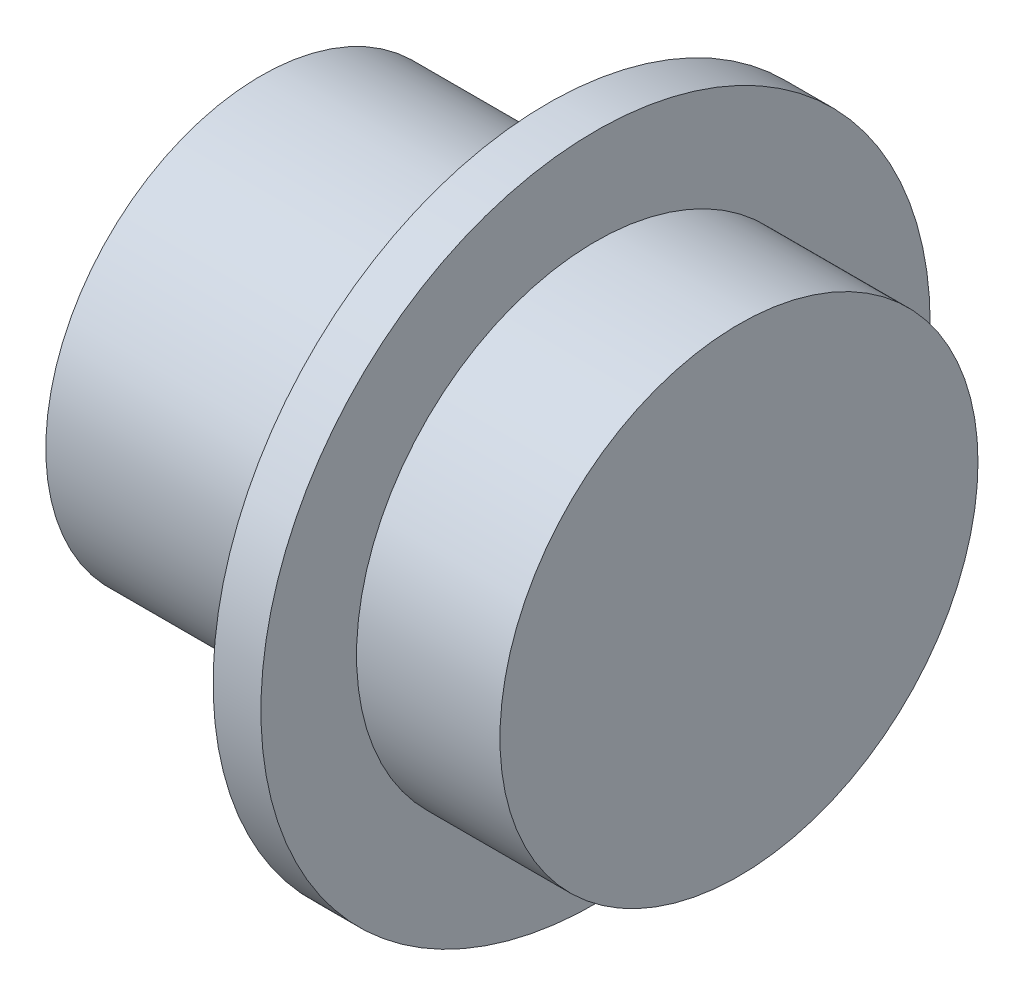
ISO-10303-21;
HEADER;
FILE_DESCRIPTION(('STEP AP214'),'2;1');
FILE_NAME('part.step','',(''),(''),'','','');
FILE_SCHEMA(('AUTOMOTIVE_DESIGN { 1 0 10303 214 1 1 1 1 }'));
ENDSEC;
DATA;
#1=APPLICATION_CONTEXT('core data for automotive mechanical design processes');
#2=APPLICATION_PROTOCOL_DEFINITION('international standard','automotive_design',2000,#1);
#3=PRODUCT_CONTEXT('',#1,'mechanical');
#4=PRODUCT('Part','Part','',(#3));
#5=PRODUCT_RELATED_PRODUCT_CATEGORY('part','',(#4));
#6=PRODUCT_DEFINITION_FORMATION('','',#4);
#7=PRODUCT_DEFINITION_CONTEXT('part definition',#1,'design');
#8=PRODUCT_DEFINITION('design','',#6,#7);
#9=PRODUCT_DEFINITION_SHAPE('','',#8);
#10=(LENGTH_UNIT() NAMED_UNIT(*) SI_UNIT(.MILLI.,.METRE.));
#11=(NAMED_UNIT(*) PLANE_ANGLE_UNIT() SI_UNIT($,.RADIAN.));
#12=(NAMED_UNIT(*) SI_UNIT($,.STERADIAN.) SOLID_ANGLE_UNIT());
#13=UNCERTAINTY_MEASURE_WITH_UNIT(LENGTH_MEASURE(1.E-05),#10,'distance_accuracy_value','');
#14=(GEOMETRIC_REPRESENTATION_CONTEXT(3) GLOBAL_UNCERTAINTY_ASSIGNED_CONTEXT((#13)) GLOBAL_UNIT_ASSIGNED_CONTEXT((#10,
#11,#12)) REPRESENTATION_CONTEXT('',''));
#15=CARTESIAN_POINT('',(0.,0.,0.));
#16=DIRECTION('',(0.,0.,1.));
#17=DIRECTION('',(1.,0.,0.));
#18=AXIS2_PLACEMENT_3D('',#15,#16,#17);
#19=CARTESIAN_POINT('',(51.,22.5,0.));
#20=DIRECTION('',(-1.,0.,0.));
#21=DIRECTION('',(0.,0.,1.));
#22=AXIS2_PLACEMENT_3D('',#19,#20,#21);
#23=PLANE('',#22);
#24=CARTESIAN_POINT('',(51.,18.,0.));
#25=DIRECTION('',(1.,0.,0.));
#26=DIRECTION('',(0.,0.,-1.));
#27=AXIS2_PLACEMENT_3D('',#24,#25,#26);
#28=CIRCLE('',#27,4.5);
#29=CARTESIAN_POINT('',(51.,18.,-4.5));
#30=VERTEX_POINT('',#29);
#31=EDGE_CURVE('E51',#30,#30,#28,.T.);
#32=ORIENTED_EDGE('',*,*,#31,.F.);
#33=EDGE_LOOP('',(#32));
#34=FACE_BOUND('',#33,.T.);
#35=ADVANCED_FACE('F29',(#34),#23,.T.);
#36=CARTESIAN_POINT('',(61.,23.,0.));
#37=DIRECTION('',(1.,0.,0.));
#38=DIRECTION('',(0.,0.,-1.));
#39=AXIS2_PLACEMENT_3D('',#36,#37,#38);
#40=PLANE('',#39);
#41=CARTESIAN_POINT('',(61.,18.,0.));
#42=DIRECTION('',(1.,0.,0.));
#43=DIRECTION('',(0.,0.,-1.));
#44=AXIS2_PLACEMENT_3D('',#41,#42,#43);
#45=CIRCLE('',#44,5.);
#46=CARTESIAN_POINT('',(61.,18.,-5.));
#47=VERTEX_POINT('',#46);
#48=EDGE_CURVE('E10',#47,#47,#45,.T.);
#49=ORIENTED_EDGE('',*,*,#48,.T.);
#50=EDGE_LOOP('',(#49));
#51=FACE_BOUND('',#50,.T.);
#52=ADVANCED_FACE('F59',(#51),#40,.T.);
#53=CARTESIAN_POINT('',(58.,18.,0.));
#54=DIRECTION('',(1.,0.,0.));
#55=DIRECTION('',(0.,0.,-1.));
#56=AXIS2_PLACEMENT_3D('',#53,#54,#55);
#57=CYLINDRICAL_SURFACE('',#56,5.);
#58=CARTESIAN_POINT('',(58.,18.,0.));
#59=DIRECTION('',(1.,0.,0.));
#60=DIRECTION('',(0.,0.,-1.));
#61=AXIS2_PLACEMENT_3D('',#58,#59,#60);
#62=CIRCLE('',#61,5.);
#63=CARTESIAN_POINT('',(58.,18.,-5.));
#64=VERTEX_POINT('',#63);
#65=EDGE_CURVE('E35',#64,#64,#62,.T.);
#66=ORIENTED_EDGE('',*,*,#65,.T.);
#67=EDGE_LOOP('',(#66));
#68=FACE_BOUND('',#67,.T.);
#69=ORIENTED_EDGE('',*,*,#48,.F.);
#70=EDGE_LOOP('',(#69));
#71=FACE_BOUND('',#70,.T.);
#72=ADVANCED_FACE('F63',(#68,#71),#57,.T.);
#73=CARTESIAN_POINT('',(58.,25.,0.));
#74=DIRECTION('',(1.,0.,0.));
#75=DIRECTION('',(0.,0.,-1.));
#76=AXIS2_PLACEMENT_3D('',#73,#74,#75);
#77=PLANE('',#76);
#78=CARTESIAN_POINT('',(58.,18.,0.));
#79=DIRECTION('',(1.,0.,0.));
#80=DIRECTION('',(0.,0.,-1.));
#81=AXIS2_PLACEMENT_3D('',#78,#79,#80);
#82=CIRCLE('',#81,7.);
#83=CARTESIAN_POINT('',(58.,18.,-7.));
#84=VERTEX_POINT('',#83);
#85=EDGE_CURVE('E39',#84,#84,#82,.T.);
#86=ORIENTED_EDGE('',*,*,#85,.T.);
#87=EDGE_LOOP('',(#86));
#88=FACE_BOUND('',#87,.T.);
#89=ORIENTED_EDGE('',*,*,#65,.F.);
#90=EDGE_LOOP('',(#89));
#91=FACE_BOUND('',#90,.T.);
#92=ADVANCED_FACE('F67',(#88,#91),#77,.T.);
#93=CARTESIAN_POINT('',(58.,18.,0.));
#94=DIRECTION('',(1.,0.,0.));
#95=DIRECTION('',(0.,0.,-1.));
#96=AXIS2_PLACEMENT_3D('',#93,#94,#95);
#97=CYLINDRICAL_SURFACE('',#96,7.);
#98=CARTESIAN_POINT('',(57.,18.,0.));
#99=DIRECTION('',(1.,0.,0.));
#100=DIRECTION('',(0.,0.,-1.));
#101=AXIS2_PLACEMENT_3D('',#98,#99,#100);
#102=CIRCLE('',#101,7.);
#103=CARTESIAN_POINT('',(57.,18.,-7.));
#104=VERTEX_POINT('',#103);
#105=EDGE_CURVE('E43',#104,#104,#102,.T.);
#106=ORIENTED_EDGE('',*,*,#105,.T.);
#107=EDGE_LOOP('',(#106));
#108=FACE_BOUND('',#107,.T.);
#109=ORIENTED_EDGE('',*,*,#85,.F.);
#110=EDGE_LOOP('',(#109));
#111=FACE_BOUND('',#110,.T.);
#112=ADVANCED_FACE('F72',(#108,#111),#97,.T.);
#113=CARTESIAN_POINT('',(57.,22.5,0.));
#114=DIRECTION('',(-1.,0.,0.));
#115=DIRECTION('',(0.,0.,1.));
#116=AXIS2_PLACEMENT_3D('',#113,#114,#115);
#117=PLANE('',#116);
#118=CARTESIAN_POINT('',(57.,18.,0.));
#119=DIRECTION('',(1.,0.,0.));
#120=DIRECTION('',(0.,0.,-1.));
#121=AXIS2_PLACEMENT_3D('',#118,#119,#120);
#122=CIRCLE('',#121,4.5);
#123=CARTESIAN_POINT('',(57.,18.,-4.5));
#124=VERTEX_POINT('',#123);
#125=EDGE_CURVE('E48',#124,#124,#122,.T.);
#126=ORIENTED_EDGE('',*,*,#125,.T.);
#127=EDGE_LOOP('',(#126));
#128=FACE_BOUND('',#127,.T.);
#129=ORIENTED_EDGE('',*,*,#105,.F.);
#130=EDGE_LOOP('',(#129));
#131=FACE_BOUND('',#130,.T.);
#132=ADVANCED_FACE('F76',(#128,#131),#117,.T.);
#133=CARTESIAN_POINT('',(58.,18.,0.));
#134=DIRECTION('',(1.,0.,0.));
#135=DIRECTION('',(0.,0.,-1.));
#136=AXIS2_PLACEMENT_3D('',#133,#134,#135);
#137=CYLINDRICAL_SURFACE('',#136,4.5);
#138=ORIENTED_EDGE('',*,*,#31,.T.);
#139=EDGE_LOOP('',(#138));
#140=FACE_BOUND('',#139,.T.);
#141=ORIENTED_EDGE('',*,*,#125,.F.);
#142=EDGE_LOOP('',(#141));
#143=FACE_BOUND('',#142,.T.);
#144=ADVANCED_FACE('F55',(#140,#143),#137,.T.);
#145=CLOSED_SHELL('',(#35,#52,#72,#92,#112,#132,#144));
#146=MANIFOLD_SOLID_BREP('B2',#145);
#147=ADVANCED_BREP_SHAPE_REPRESENTATION('',(#18,#146),#14);
#148=SHAPE_DEFINITION_REPRESENTATION(#9,#147);
ENDSEC;
END-ISO-10303-21;
